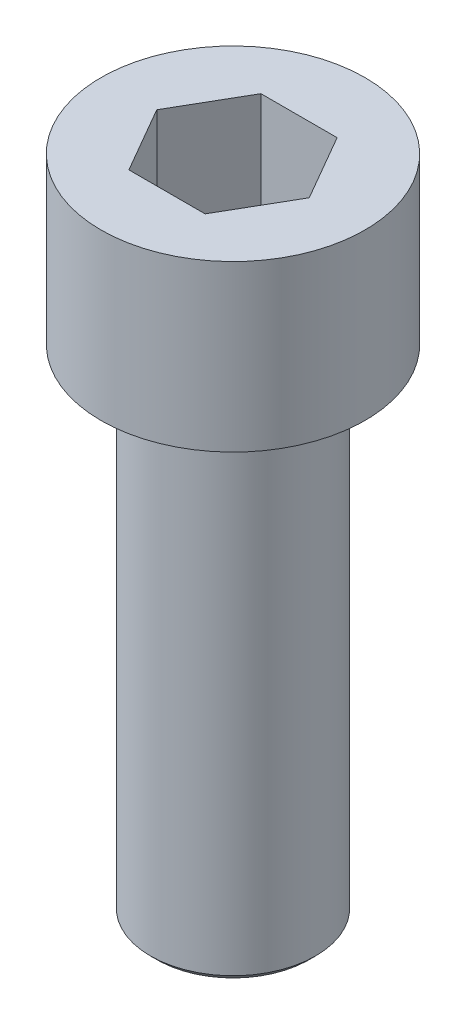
from build123d import *

# Parameters (mm, degrees)
CUT_EXTRUDE1_DEPTH = 18
FILLET1_R          = 1.2
CHAMFER1_SIZE      = 1.2


with BuildPart() as part:
    # Sketch1 → Revolve1 (revolve)
    with BuildSketch(Plane.XY, mode=Mode.PRIVATE) as revolve1_sk:
        Polygon((0, 0), (15, 0), (15, 90), (24, 90), (24, 120), (0, 120), align=None)
    revolve(revolve1_sk.sketch.rotate(Axis((0, 0, 0), (0, 1, 0)), 90), axis=Axis((0, 0, 0), (0, 1, 0)))

    # Sketch2 → Cut-Extrude1 (cut)
    with BuildSketch(Plane(origin=(0, 120, 0), x_dir=(1, 0, 0), z_dir=(0, 1, 0))):
        Polygon((13.856406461, 0), (6.92820323, 12), (-6.92820323, 12), (-13.856406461, 0), (-6.92820323, -12), (6.92820323, -12), align=None)
    extrude(amount=-CUT_EXTRUDE1_DEPTH, mode=Mode.SUBTRACT)

    # Fillet1
    fillet1_edges = [part.edges().sort_by_distance(p)[0] for p in [
        (0, 90, 15),
    ]]
    fillet(fillet1_edges, radius=FILLET1_R)

    # Chamfer1
    chamfer1_edges = [part.edges().sort_by_distance(p)[0] for p in [
        (0, 0, 15),
    ]]
    chamfer(chamfer1_edges, length=CHAMFER1_SIZE)


solid = part.part
